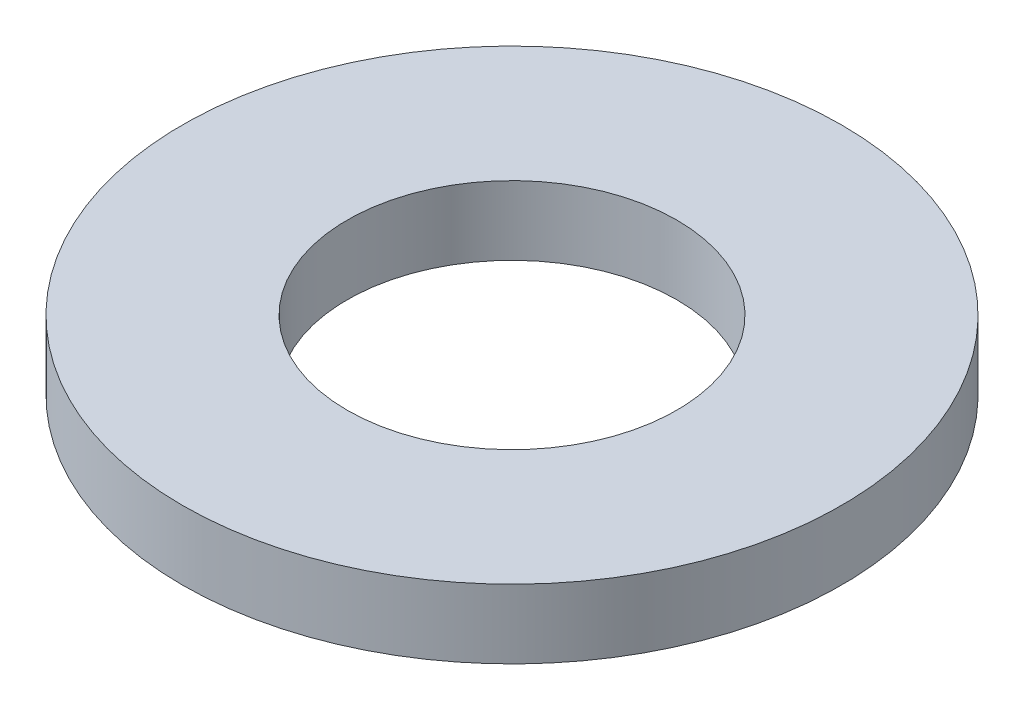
ISO-10303-21;
HEADER;
FILE_DESCRIPTION(('STEP AP214'),'2;1');
FILE_NAME('part.step','',(''),(''),'','','');
FILE_SCHEMA(('AUTOMOTIVE_DESIGN { 1 0 10303 214 1 1 1 1 }'));
ENDSEC;
DATA;
#1=APPLICATION_CONTEXT('core data for automotive mechanical design processes');
#2=APPLICATION_PROTOCOL_DEFINITION('international standard','automotive_design',2000,#1);
#3=PRODUCT_CONTEXT('',#1,'mechanical');
#4=PRODUCT('Part','Part','',(#3));
#5=PRODUCT_RELATED_PRODUCT_CATEGORY('part','',(#4));
#6=PRODUCT_DEFINITION_FORMATION('','',#4);
#7=PRODUCT_DEFINITION_CONTEXT('part definition',#1,'design');
#8=PRODUCT_DEFINITION('design','',#6,#7);
#9=PRODUCT_DEFINITION_SHAPE('','',#8);
#10=(LENGTH_UNIT() NAMED_UNIT(*) SI_UNIT(.MILLI.,.METRE.));
#11=(NAMED_UNIT(*) PLANE_ANGLE_UNIT() SI_UNIT($,.RADIAN.));
#12=(NAMED_UNIT(*) SI_UNIT($,.STERADIAN.) SOLID_ANGLE_UNIT());
#13=UNCERTAINTY_MEASURE_WITH_UNIT(LENGTH_MEASURE(1.E-05),#10,'distance_accuracy_value','');
#14=(GEOMETRIC_REPRESENTATION_CONTEXT(3) GLOBAL_UNCERTAINTY_ASSIGNED_CONTEXT((#13)) GLOBAL_UNIT_ASSIGNED_CONTEXT((#10,
#11,#12)) REPRESENTATION_CONTEXT('',''));
#15=CARTESIAN_POINT('',(0.,0.,0.));
#16=DIRECTION('',(0.,0.,1.));
#17=DIRECTION('',(1.,0.,0.));
#18=AXIS2_PLACEMENT_3D('',#15,#16,#17);
#19=CARTESIAN_POINT('',(0.,2.2,0.));
#20=DIRECTION('',(0.,-1.,0.));
#21=DIRECTION('',(0.,0.,-1.));
#22=AXIS2_PLACEMENT_3D('',#19,#20,#21);
#23=CYLINDRICAL_SURFACE('',#22,10.5);
#24=CARTESIAN_POINT('',(0.,2.2,0.));
#25=DIRECTION('',(0.,1.,0.));
#26=DIRECTION('',(0.,0.,1.));
#27=AXIS2_PLACEMENT_3D('',#24,#25,#26);
#28=CIRCLE('',#27,10.5);
#29=CARTESIAN_POINT('',(0.,2.2,10.5));
#30=VERTEX_POINT('',#29);
#31=EDGE_CURVE('E10',#30,#30,#28,.T.);
#32=ORIENTED_EDGE('',*,*,#31,.F.);
#33=EDGE_LOOP('',(#32));
#34=FACE_BOUND('',#33,.T.);
#35=CARTESIAN_POINT('',(0.,0.,0.));
#36=DIRECTION('',(0.,1.,0.));
#37=DIRECTION('',(0.,0.,1.));
#38=AXIS2_PLACEMENT_3D('',#35,#36,#37);
#39=CIRCLE('',#38,10.5);
#40=CARTESIAN_POINT('',(0.,0.,10.5));
#41=VERTEX_POINT('',#40);
#42=EDGE_CURVE('E38',#41,#41,#39,.T.);
#43=ORIENTED_EDGE('',*,*,#42,.T.);
#44=EDGE_LOOP('',(#43));
#45=FACE_BOUND('',#44,.T.);
#46=ADVANCED_FACE('F35',(#34,#45),#23,.T.);
#47=CARTESIAN_POINT('',(0.,2.2,0.));
#48=DIRECTION('',(0.,1.,0.));
#49=DIRECTION('',(0.,0.,1.));
#50=AXIS2_PLACEMENT_3D('',#47,#48,#49);
#51=PLANE('',#50);
#52=CARTESIAN_POINT('',(0.,2.2,0.));
#53=DIRECTION('',(0.,1.,0.));
#54=DIRECTION('',(0.,0.,1.));
#55=AXIS2_PLACEMENT_3D('',#52,#53,#54);
#56=CIRCLE('',#55,5.25);
#57=CARTESIAN_POINT('',(0.,2.2,5.25));
#58=VERTEX_POINT('',#57);
#59=EDGE_CURVE('E47',#58,#58,#56,.T.);
#60=ORIENTED_EDGE('',*,*,#59,.F.);
#61=EDGE_LOOP('',(#60));
#62=FACE_BOUND('',#61,.T.);
#63=ORIENTED_EDGE('',*,*,#31,.T.);
#64=EDGE_LOOP('',(#63));
#65=FACE_BOUND('',#64,.T.);
#66=ADVANCED_FACE('F62',(#62,#65),#51,.T.);
#67=CARTESIAN_POINT('',(0.,0.,0.));
#68=DIRECTION('',(0.,1.,0.));
#69=DIRECTION('',(0.,0.,1.));
#70=AXIS2_PLACEMENT_3D('',#67,#68,#69);
#71=PLANE('',#70);
#72=CARTESIAN_POINT('',(0.,0.,0.));
#73=DIRECTION('',(0.,1.,0.));
#74=DIRECTION('',(0.,0.,1.));
#75=AXIS2_PLACEMENT_3D('',#72,#73,#74);
#76=CIRCLE('',#75,5.25);
#77=CARTESIAN_POINT('',(0.,0.,5.25));
#78=VERTEX_POINT('',#77);
#79=EDGE_CURVE('E45',#78,#78,#76,.T.);
#80=ORIENTED_EDGE('',*,*,#79,.T.);
#81=EDGE_LOOP('',(#80));
#82=FACE_BOUND('',#81,.T.);
#83=ORIENTED_EDGE('',*,*,#42,.F.);
#84=EDGE_LOOP('',(#83));
#85=FACE_BOUND('',#84,.T.);
#86=ADVANCED_FACE('F53',(#82,#85),#71,.F.);
#87=CARTESIAN_POINT('',(0.,0.,0.));
#88=DIRECTION('',(0.,1.,0.));
#89=DIRECTION('',(0.,0.,1.));
#90=AXIS2_PLACEMENT_3D('',#87,#88,#89);
#91=CYLINDRICAL_SURFACE('',#90,5.25);
#92=ORIENTED_EDGE('',*,*,#79,.F.);
#93=EDGE_LOOP('',(#92));
#94=FACE_BOUND('',#93,.T.);
#95=ORIENTED_EDGE('',*,*,#59,.T.);
#96=EDGE_LOOP('',(#95));
#97=FACE_BOUND('',#96,.T.);
#98=ADVANCED_FACE('F56',(#94,#97),#91,.F.);
#99=CLOSED_SHELL('',(#46,#66,#86,#98));
#100=MANIFOLD_SOLID_BREP('B2',#99);
#101=ADVANCED_BREP_SHAPE_REPRESENTATION('',(#18,#100),#14);
#102=SHAPE_DEFINITION_REPRESENTATION(#9,#101);
ENDSEC;
END-ISO-10303-21;
